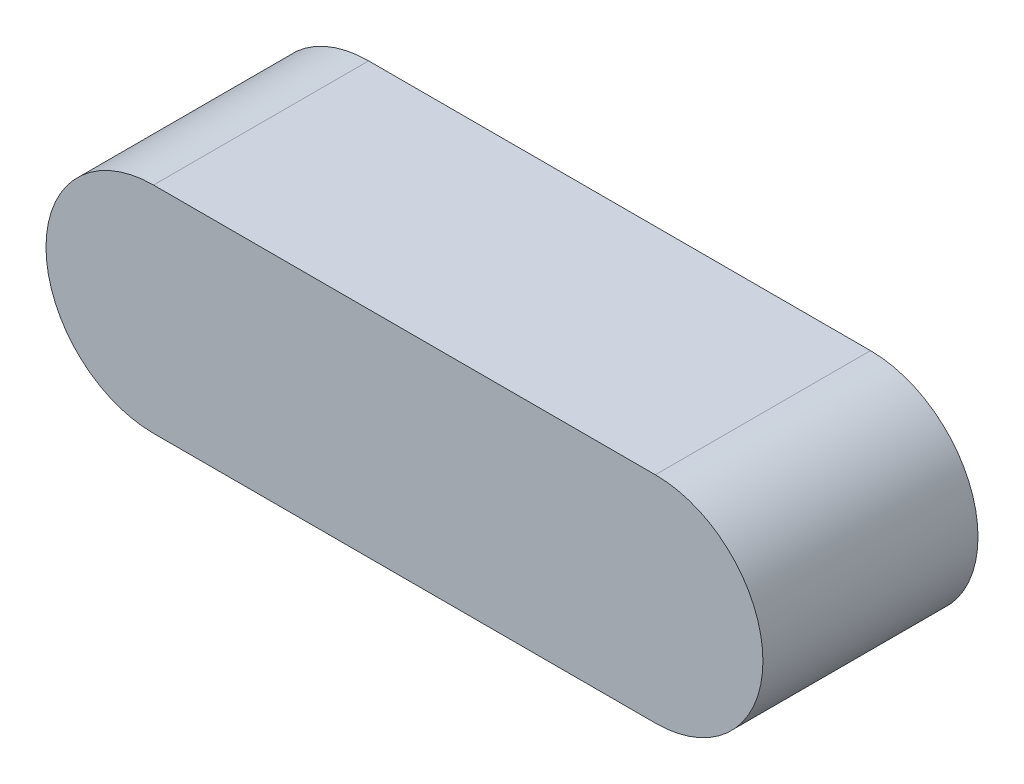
ISO-10303-21;
HEADER;
FILE_DESCRIPTION(('STEP AP214'),'2;1');
FILE_NAME('part.step','',(''),(''),'','','');
FILE_SCHEMA(('AUTOMOTIVE_DESIGN { 1 0 10303 214 1 1 1 1 }'));
ENDSEC;
DATA;
#1=APPLICATION_CONTEXT('core data for automotive mechanical design processes');
#2=APPLICATION_PROTOCOL_DEFINITION('international standard','automotive_design',2000,#1);
#3=PRODUCT_CONTEXT('',#1,'mechanical');
#4=PRODUCT('Part','Part','',(#3));
#5=PRODUCT_RELATED_PRODUCT_CATEGORY('part','',(#4));
#6=PRODUCT_DEFINITION_FORMATION('','',#4);
#7=PRODUCT_DEFINITION_CONTEXT('part definition',#1,'design');
#8=PRODUCT_DEFINITION('design','',#6,#7);
#9=PRODUCT_DEFINITION_SHAPE('','',#8);
#10=(LENGTH_UNIT() NAMED_UNIT(*) SI_UNIT(.MILLI.,.METRE.));
#11=(NAMED_UNIT(*) PLANE_ANGLE_UNIT() SI_UNIT($,.RADIAN.));
#12=(NAMED_UNIT(*) SI_UNIT($,.STERADIAN.) SOLID_ANGLE_UNIT());
#13=UNCERTAINTY_MEASURE_WITH_UNIT(LENGTH_MEASURE(1.E-05),#10,'distance_accuracy_value','');
#14=(GEOMETRIC_REPRESENTATION_CONTEXT(3) GLOBAL_UNCERTAINTY_ASSIGNED_CONTEXT((#13)) GLOBAL_UNIT_ASSIGNED_CONTEXT((#10,
#11,#12)) REPRESENTATION_CONTEXT('',''));
#15=CARTESIAN_POINT('',(0.,0.,0.));
#16=DIRECTION('',(0.,0.,1.));
#17=DIRECTION('',(1.,0.,0.));
#18=AXIS2_PLACEMENT_3D('',#15,#16,#17);
#19=CARTESIAN_POINT('',(0.,-1.5,3.));
#20=DIRECTION('',(0.,0.,-1.));
#21=DIRECTION('',(-1.,0.,0.));
#22=AXIS2_PLACEMENT_3D('',#19,#20,#21);
#23=CYLINDRICAL_SURFACE('',#22,1.5);
#24=CARTESIAN_POINT('',(0.,-1.5,0.));
#25=DIRECTION('',(0.,0.,1.));
#26=DIRECTION('',(1.,0.,0.));
#27=AXIS2_PLACEMENT_3D('',#24,#25,#26);
#28=CIRCLE('',#27,1.5);
#29=CARTESIAN_POINT('',(0.,0.,0.));
#30=VERTEX_POINT('',#29);
#31=CARTESIAN_POINT('',(0.,-3.,0.));
#32=VERTEX_POINT('',#31);
#33=EDGE_CURVE('E95',#30,#32,#28,.T.);
#34=ORIENTED_EDGE('',*,*,#33,.T.);
#35=DIRECTION('',(0.,0.,-1.));
#36=VECTOR('',#35,1.);
#37=CARTESIAN_POINT('',(0.,-3.,3.));
#38=LINE('',#37,#36);
#39=CARTESIAN_POINT('',(0.,-3.,3.));
#40=VERTEX_POINT('',#39);
#41=EDGE_CURVE('E11',#40,#32,#38,.T.);
#42=ORIENTED_EDGE('',*,*,#41,.F.);
#43=CARTESIAN_POINT('',(0.,-1.5,3.));
#44=DIRECTION('',(0.,0.,1.));
#45=DIRECTION('',(1.,0.,0.));
#46=AXIS2_PLACEMENT_3D('',#43,#44,#45);
#47=CIRCLE('',#46,1.5);
#48=CARTESIAN_POINT('',(0.,0.,3.));
#49=VERTEX_POINT('',#48);
#50=EDGE_CURVE('E83',#49,#40,#47,.T.);
#51=ORIENTED_EDGE('',*,*,#50,.F.);
#52=DIRECTION('',(0.,0.,-1.));
#53=VECTOR('',#52,1.);
#54=CARTESIAN_POINT('',(0.,0.,3.));
#55=LINE('',#54,#53);
#56=EDGE_CURVE('E91',#49,#30,#55,.T.);
#57=ORIENTED_EDGE('',*,*,#56,.T.);
#58=EDGE_LOOP('',(#34,#42,#51,#57));
#59=FACE_BOUND('',#58,.T.);
#60=ADVANCED_FACE('F32',(#59),#23,.T.);
#61=CARTESIAN_POINT('',(0.,-3.,3.));
#62=DIRECTION('',(0.,1.,0.));
#63=DIRECTION('',(0.,0.,1.));
#64=AXIS2_PLACEMENT_3D('',#61,#62,#63);
#65=PLANE('',#64);
#66=DIRECTION('',(1.,0.,0.));
#67=VECTOR('',#66,1.);
#68=CARTESIAN_POINT('',(0.,-3.,0.));
#69=LINE('',#68,#67);
#70=CARTESIAN_POINT('',(7.,-3.,0.));
#71=VERTEX_POINT('',#70);
#72=EDGE_CURVE('E87',#32,#71,#69,.T.);
#73=ORIENTED_EDGE('',*,*,#72,.T.);
#74=DIRECTION('',(0.,0.,-1.));
#75=VECTOR('',#74,1.);
#76=CARTESIAN_POINT('',(7.,-3.,3.));
#77=LINE('',#76,#75);
#78=CARTESIAN_POINT('',(7.,-3.,3.));
#79=VERTEX_POINT('',#78);
#80=EDGE_CURVE('E40',#79,#71,#77,.T.);
#81=ORIENTED_EDGE('',*,*,#80,.F.);
#82=DIRECTION('',(1.,0.,0.));
#83=VECTOR('',#82,1.);
#84=CARTESIAN_POINT('',(0.,-3.,3.));
#85=LINE('',#84,#83);
#86=EDGE_CURVE('E78',#40,#79,#85,.T.);
#87=ORIENTED_EDGE('',*,*,#86,.F.);
#88=ORIENTED_EDGE('',*,*,#41,.T.);
#89=EDGE_LOOP('',(#73,#81,#87,#88));
#90=FACE_BOUND('',#89,.T.);
#91=ADVANCED_FACE('F86',(#90),#65,.F.);
#92=CARTESIAN_POINT('',(7.,-1.5,3.));
#93=DIRECTION('',(0.,0.,-1.));
#94=DIRECTION('',(-1.,0.,0.));
#95=AXIS2_PLACEMENT_3D('',#92,#93,#94);
#96=CYLINDRICAL_SURFACE('',#95,1.5);
#97=CARTESIAN_POINT('',(7.,-1.5,0.));
#98=DIRECTION('',(0.,0.,1.));
#99=DIRECTION('',(-1.,0.,0.));
#100=AXIS2_PLACEMENT_3D('',#97,#98,#99);
#101=CIRCLE('',#100,1.5);
#102=CARTESIAN_POINT('',(7.,0.,0.));
#103=VERTEX_POINT('',#102);
#104=EDGE_CURVE('E65',#71,#103,#101,.T.);
#105=ORIENTED_EDGE('',*,*,#104,.T.);
#106=DIRECTION('',(0.,0.,-1.));
#107=VECTOR('',#106,1.);
#108=CARTESIAN_POINT('',(7.,0.,3.));
#109=LINE('',#108,#107);
#110=CARTESIAN_POINT('',(7.,0.,3.));
#111=VERTEX_POINT('',#110);
#112=EDGE_CURVE('E88',#111,#103,#109,.T.);
#113=ORIENTED_EDGE('',*,*,#112,.F.);
#114=CARTESIAN_POINT('',(7.,-1.5,3.));
#115=DIRECTION('',(0.,0.,1.));
#116=DIRECTION('',(-1.,0.,0.));
#117=AXIS2_PLACEMENT_3D('',#114,#115,#116);
#118=CIRCLE('',#117,1.5);
#119=EDGE_CURVE('E81',#79,#111,#118,.T.);
#120=ORIENTED_EDGE('',*,*,#119,.F.);
#121=ORIENTED_EDGE('',*,*,#80,.T.);
#122=EDGE_LOOP('',(#105,#113,#120,#121));
#123=FACE_BOUND('',#122,.T.);
#124=ADVANCED_FACE('F89',(#123),#96,.T.);
#125=CARTESIAN_POINT('',(0.,0.,3.));
#126=DIRECTION('',(0.,-1.,0.));
#127=DIRECTION('',(0.,0.,-1.));
#128=AXIS2_PLACEMENT_3D('',#125,#126,#127);
#129=PLANE('',#128);
#130=DIRECTION('',(-1.,0.,0.));
#131=VECTOR('',#130,1.);
#132=CARTESIAN_POINT('',(0.,0.,0.));
#133=LINE('',#132,#131);
#134=EDGE_CURVE('E71',#103,#30,#133,.T.);
#135=ORIENTED_EDGE('',*,*,#134,.T.);
#136=ORIENTED_EDGE('',*,*,#56,.F.);
#137=DIRECTION('',(-1.,0.,0.));
#138=VECTOR('',#137,1.);
#139=CARTESIAN_POINT('',(0.,0.,3.));
#140=LINE('',#139,#138);
#141=EDGE_CURVE('E48',#111,#49,#140,.T.);
#142=ORIENTED_EDGE('',*,*,#141,.F.);
#143=ORIENTED_EDGE('',*,*,#112,.T.);
#144=EDGE_LOOP('',(#135,#136,#142,#143));
#145=FACE_BOUND('',#144,.T.);
#146=ADVANCED_FACE('F102',(#145),#129,.F.);
#147=CARTESIAN_POINT('',(0.,-1.5,3.));
#148=DIRECTION('',(0.,0.,1.));
#149=DIRECTION('',(1.,0.,0.));
#150=AXIS2_PLACEMENT_3D('',#147,#148,#149);
#151=PLANE('',#150);
#152=ORIENTED_EDGE('',*,*,#50,.T.);
#153=ORIENTED_EDGE('',*,*,#86,.T.);
#154=ORIENTED_EDGE('',*,*,#119,.T.);
#155=ORIENTED_EDGE('',*,*,#141,.T.);
#156=EDGE_LOOP('',(#152,#153,#154,#155));
#157=FACE_BOUND('',#156,.T.);
#158=ADVANCED_FACE('F79',(#157),#151,.T.);
#159=CARTESIAN_POINT('',(0.,-1.5,0.));
#160=DIRECTION('',(0.,0.,1.));
#161=DIRECTION('',(1.,0.,0.));
#162=AXIS2_PLACEMENT_3D('',#159,#160,#161);
#163=PLANE('',#162);
#164=ORIENTED_EDGE('',*,*,#33,.F.);
#165=ORIENTED_EDGE('',*,*,#134,.F.);
#166=ORIENTED_EDGE('',*,*,#104,.F.);
#167=ORIENTED_EDGE('',*,*,#72,.F.);
#168=EDGE_LOOP('',(#164,#165,#166,#167));
#169=FACE_BOUND('',#168,.T.);
#170=ADVANCED_FACE('F105',(#169),#163,.F.);
#171=CLOSED_SHELL('',(#60,#91,#124,#146,#158,#170));
#172=MANIFOLD_SOLID_BREP('B2',#171);
#173=ADVANCED_BREP_SHAPE_REPRESENTATION('',(#18,#172),#14);
#174=SHAPE_DEFINITION_REPRESENTATION(#9,#173);
ENDSEC;
END-ISO-10303-21;
